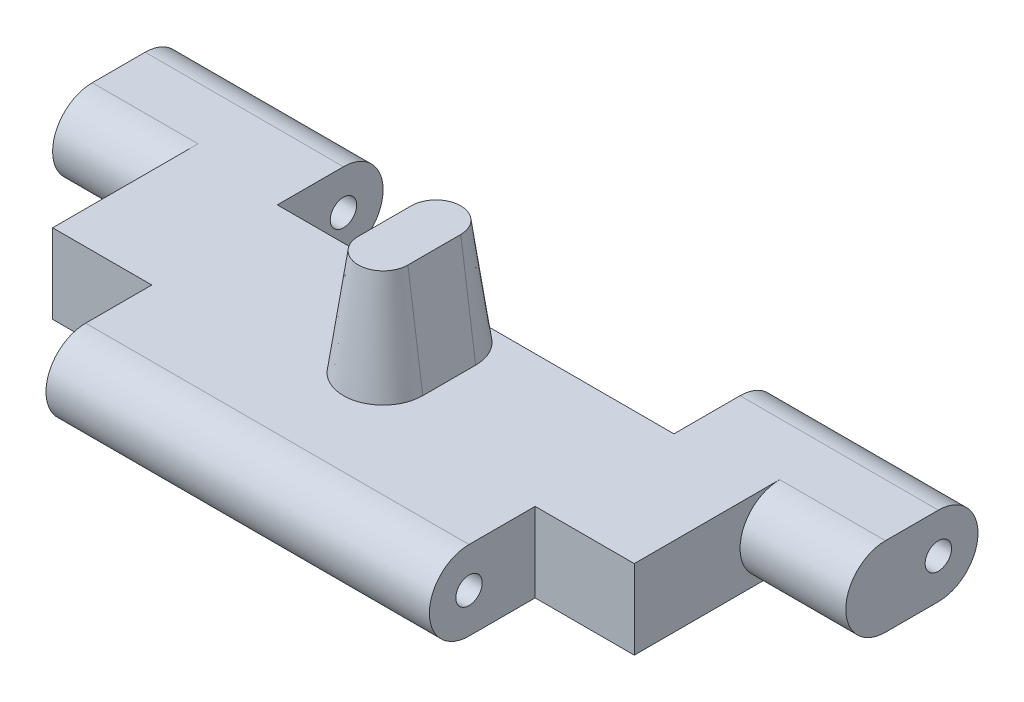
ISO-10303-21;
HEADER;
FILE_DESCRIPTION(('STEP AP214'),'2;1');
FILE_NAME('part.step','',(''),(''),'','','');
FILE_SCHEMA(('AUTOMOTIVE_DESIGN { 1 0 10303 214 1 1 1 1 }'));
ENDSEC;
DATA;
#1=APPLICATION_CONTEXT('core data for automotive mechanical design processes');
#2=APPLICATION_PROTOCOL_DEFINITION('international standard','automotive_design',2000,#1);
#3=PRODUCT_CONTEXT('',#1,'mechanical');
#4=PRODUCT('Part','Part','',(#3));
#5=PRODUCT_RELATED_PRODUCT_CATEGORY('part','',(#4));
#6=PRODUCT_DEFINITION_FORMATION('','',#4);
#7=PRODUCT_DEFINITION_CONTEXT('part definition',#1,'design');
#8=PRODUCT_DEFINITION('design','',#6,#7);
#9=PRODUCT_DEFINITION_SHAPE('','',#8);
#10=(LENGTH_UNIT() NAMED_UNIT(*) SI_UNIT(.MILLI.,.METRE.));
#11=(NAMED_UNIT(*) PLANE_ANGLE_UNIT() SI_UNIT($,.RADIAN.));
#12=(NAMED_UNIT(*) SI_UNIT($,.STERADIAN.) SOLID_ANGLE_UNIT());
#13=UNCERTAINTY_MEASURE_WITH_UNIT(LENGTH_MEASURE(1.E-05),#10,'distance_accuracy_value','');
#14=(GEOMETRIC_REPRESENTATION_CONTEXT(3) GLOBAL_UNCERTAINTY_ASSIGNED_CONTEXT((#13)) GLOBAL_UNIT_ASSIGNED_CONTEXT((#10,
#11,#12)) REPRESENTATION_CONTEXT('',''));
#15=CARTESIAN_POINT('',(0.,0.,0.));
#16=DIRECTION('',(0.,0.,1.));
#17=DIRECTION('',(1.,0.,0.));
#18=AXIS2_PLACEMENT_3D('',#15,#16,#17);
#19=CARTESIAN_POINT('',(15.,1.5,5.));
#20=DIRECTION('',(0.,-1.,0.));
#21=DIRECTION('',(0.,0.,-1.));
#22=AXIS2_PLACEMENT_3D('',#19,#20,#21);
#23=PLANE('',#22);
#24=CARTESIAN_POINT('',(0.,1.5,-1.));
#25=DIRECTION('',(0.,1.,0.));
#26=DIRECTION('',(0.,0.,1.));
#27=AXIS2_PLACEMENT_3D('',#24,#25,#26);
#28=CIRCLE('',#27,1.5);
#29=CARTESIAN_POINT('',(1.5,1.5,-1.));
#30=VERTEX_POINT('',#29);
#31=CARTESIAN_POINT('',(0.,1.5,-2.5));
#32=VERTEX_POINT('',#31);
#33=EDGE_CURVE('E185',#30,#32,#28,.T.);
#34=ORIENTED_EDGE('',*,*,#33,.F.);
#35=DIRECTION('',(0.,0.,-1.));
#36=VECTOR('',#35,1.);
#37=CARTESIAN_POINT('',(1.5,1.5,-1.));
#38=LINE('',#37,#36);
#39=CARTESIAN_POINT('',(1.5,1.5,1.));
#40=VERTEX_POINT('',#39);
#41=EDGE_CURVE('E187',#40,#30,#38,.T.);
#42=ORIENTED_EDGE('',*,*,#41,.F.);
#43=CARTESIAN_POINT('',(0.,1.5,1.));
#44=DIRECTION('',(0.,1.,0.));
#45=DIRECTION('',(0.,0.,1.));
#46=AXIS2_PLACEMENT_3D('',#43,#44,#45);
#47=CIRCLE('',#46,1.5);
#48=CARTESIAN_POINT('',(-1.5,1.5,1.));
#49=VERTEX_POINT('',#48);
#50=EDGE_CURVE('E68',#49,#40,#47,.T.);
#51=ORIENTED_EDGE('',*,*,#50,.F.);
#52=DIRECTION('',(0.,0.,1.));
#53=VECTOR('',#52,1.);
#54=CARTESIAN_POINT('',(-1.5,1.5,-0.999999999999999));
#55=LINE('',#54,#53);
#56=CARTESIAN_POINT('',(-1.5,1.5,-0.999999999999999));
#57=VERTEX_POINT('',#56);
#58=EDGE_CURVE('E63',#57,#49,#55,.T.);
#59=ORIENTED_EDGE('',*,*,#58,.F.);
#60=EDGE_CURVE('E193',#32,#57,#28,.T.);
#61=ORIENTED_EDGE('',*,*,#60,.F.);
#62=DIRECTION('',(1.,0.,0.));
#63=VECTOR('',#62,1.);
#64=CARTESIAN_POINT('',(-7.5,1.5,-2.5));
#65=LINE('',#64,#63);
#66=CARTESIAN_POINT('',(-7.5,1.5,-2.5));
#67=VERTEX_POINT('',#66);
#68=EDGE_CURVE('E296',#67,#32,#65,.T.);
#69=ORIENTED_EDGE('',*,*,#68,.F.);
#70=DIRECTION('',(0.,0.,1.));
#71=VECTOR('',#70,1.);
#72=CARTESIAN_POINT('',(-7.5,1.5,-2.5));
#73=LINE('',#72,#71);
#74=CARTESIAN_POINT('',(-7.5,1.5,-5.));
#75=VERTEX_POINT('',#74);
#76=EDGE_CURVE('E293',#75,#67,#73,.T.);
#77=ORIENTED_EDGE('',*,*,#76,.F.);
#78=DIRECTION('',(-1.,0.,0.));
#79=VECTOR('',#78,1.);
#80=CARTESIAN_POINT('',(15.,1.5,-5.));
#81=LINE('',#80,#79);
#82=CARTESIAN_POINT('',(-15.,1.5,-5.));
#83=VERTEX_POINT('',#82);
#84=EDGE_CURVE('E345',#75,#83,#81,.T.);
#85=ORIENTED_EDGE('',*,*,#84,.T.);
#86=DIRECTION('',(0.,0.,1.));
#87=VECTOR('',#86,1.);
#88=CARTESIAN_POINT('',(-15.,1.5,5.));
#89=LINE('',#88,#87);
#90=CARTESIAN_POINT('',(-15.,1.5,-3.));
#91=VERTEX_POINT('',#90);
#92=EDGE_CURVE('E331',#83,#91,#89,.T.);
#93=ORIENTED_EDGE('',*,*,#92,.T.);
#94=DIRECTION('',(-1.,0.,0.));
#95=VECTOR('',#94,1.);
#96=CARTESIAN_POINT('',(-11.,1.5,-3.));
#97=LINE('',#96,#95);
#98=CARTESIAN_POINT('',(-11.,1.5,-3.));
#99=VERTEX_POINT('',#98);
#100=EDGE_CURVE('E257',#99,#91,#97,.T.);
#101=ORIENTED_EDGE('',*,*,#100,.F.);
#102=DIRECTION('',(0.,0.,-1.));
#103=VECTOR('',#102,1.);
#104=CARTESIAN_POINT('',(-11.,1.5,-3.));
#105=LINE('',#104,#103);
#106=CARTESIAN_POINT('',(-11.,1.5,2.5));
#107=VERTEX_POINT('',#106);
#108=EDGE_CURVE('E252',#107,#99,#105,.T.);
#109=ORIENTED_EDGE('',*,*,#108,.F.);
#110=DIRECTION('',(-1.,0.,0.));
#111=VECTOR('',#110,1.);
#112=CARTESIAN_POINT('',(-15.,1.5,2.5));
#113=LINE('',#112,#111);
#114=CARTESIAN_POINT('',(-7.25,1.5,2.5));
#115=VERTEX_POINT('',#114);
#116=EDGE_CURVE('E278',#115,#107,#113,.T.);
#117=ORIENTED_EDGE('',*,*,#116,.F.);
#118=DIRECTION('',(0.,0.,-1.));
#119=VECTOR('',#118,1.);
#120=CARTESIAN_POINT('',(-7.25,1.5,6.5));
#121=LINE('',#120,#119);
#122=CARTESIAN_POINT('',(-7.25,1.5,5.));
#123=VERTEX_POINT('',#122);
#124=EDGE_CURVE('E259',#123,#115,#121,.T.);
#125=ORIENTED_EDGE('',*,*,#124,.F.);
#126=DIRECTION('',(-1.,0.,0.));
#127=VECTOR('',#126,1.);
#128=CARTESIAN_POINT('',(15.,1.5,5.));
#129=LINE('',#128,#127);
#130=CARTESIAN_POINT('',(7.25,1.5,5.));
#131=VERTEX_POINT('',#130);
#132=EDGE_CURVE('E336',#131,#123,#129,.T.);
#133=ORIENTED_EDGE('',*,*,#132,.F.);
#134=DIRECTION('',(0.,0.,1.));
#135=VECTOR('',#134,1.);
#136=CARTESIAN_POINT('',(7.25,1.5,6.5));
#137=LINE('',#136,#135);
#138=CARTESIAN_POINT('',(7.25,1.5,2.5));
#139=VERTEX_POINT('',#138);
#140=EDGE_CURVE('E264',#139,#131,#137,.T.);
#141=ORIENTED_EDGE('',*,*,#140,.F.);
#142=DIRECTION('',(-1.,0.,0.));
#143=VECTOR('',#142,1.);
#144=CARTESIAN_POINT('',(15.,1.5,2.5));
#145=LINE('',#144,#143);
#146=CARTESIAN_POINT('',(11.,1.5,2.5));
#147=VERTEX_POINT('',#146);
#148=EDGE_CURVE('E262',#147,#139,#145,.T.);
#149=ORIENTED_EDGE('',*,*,#148,.F.);
#150=DIRECTION('',(0.,0.,-1.));
#151=VECTOR('',#150,1.);
#152=CARTESIAN_POINT('',(11.,1.5,-3.));
#153=LINE('',#152,#151);
#154=CARTESIAN_POINT('',(11.,1.5,-3.));
#155=VERTEX_POINT('',#154);
#156=EDGE_CURVE('E227',#147,#155,#153,.T.);
#157=ORIENTED_EDGE('',*,*,#156,.T.);
#158=DIRECTION('',(1.,0.,0.));
#159=VECTOR('',#158,1.);
#160=CARTESIAN_POINT('',(11.,1.5,-3.));
#161=LINE('',#160,#159);
#162=CARTESIAN_POINT('',(15.,1.5,-3.));
#163=VERTEX_POINT('',#162);
#164=EDGE_CURVE('E237',#155,#163,#161,.T.);
#165=ORIENTED_EDGE('',*,*,#164,.T.);
#166=DIRECTION('',(0.,0.,1.));
#167=VECTOR('',#166,1.);
#168=CARTESIAN_POINT('',(15.,1.5,5.));
#169=LINE('',#168,#167);
#170=CARTESIAN_POINT('',(15.,1.5,-5.));
#171=VERTEX_POINT('',#170);
#172=EDGE_CURVE('E333',#171,#163,#169,.T.);
#173=ORIENTED_EDGE('',*,*,#172,.F.);
#174=CARTESIAN_POINT('',(7.5,1.5,-5.));
#175=VERTEX_POINT('',#174);
#176=EDGE_CURVE('E346',#171,#175,#81,.T.);
#177=ORIENTED_EDGE('',*,*,#176,.T.);
#178=DIRECTION('',(0.,0.,-1.));
#179=VECTOR('',#178,1.);
#180=CARTESIAN_POINT('',(7.5,1.5,-2.5));
#181=LINE('',#180,#179);
#182=CARTESIAN_POINT('',(7.5,1.5,-2.5));
#183=VERTEX_POINT('',#182);
#184=EDGE_CURVE('E298',#183,#175,#181,.T.);
#185=ORIENTED_EDGE('',*,*,#184,.F.);
#186=EDGE_CURVE('E189',#32,#183,#65,.T.);
#187=ORIENTED_EDGE('',*,*,#186,.F.);
#188=EDGE_LOOP('',(#34,#42,#51,#59,#61,#69,#77,#85,#93,#101,#109,#117,#125,#133,#141,#149,#157,
#165,#173,#177,#185,#187));
#189=FACE_BOUND('',#188,.T.);
#190=ADVANCED_FACE('F46',(#189),#23,.F.);
#191=CARTESIAN_POINT('',(15.,-1.5,5.));
#192=DIRECTION('',(0.,1.,0.));
#193=DIRECTION('',(0.,0.,1.));
#194=AXIS2_PLACEMENT_3D('',#191,#192,#193);
#195=PLANE('',#194);
#196=DIRECTION('',(1.,0.,0.));
#197=VECTOR('',#196,1.);
#198=CARTESIAN_POINT('',(11.,-1.5,-3.));
#199=LINE('',#198,#197);
#200=CARTESIAN_POINT('',(11.,-1.5,-3.));
#201=VERTEX_POINT('',#200);
#202=CARTESIAN_POINT('',(15.,-1.5,-3.));
#203=VERTEX_POINT('',#202);
#204=EDGE_CURVE('E240',#201,#203,#199,.T.);
#205=ORIENTED_EDGE('',*,*,#204,.F.);
#206=DIRECTION('',(0.,0.,1.));
#207=VECTOR('',#206,1.);
#208=CARTESIAN_POINT('',(11.,-1.5,2.5));
#209=LINE('',#208,#207);
#210=CARTESIAN_POINT('',(11.,-1.5,2.5));
#211=VERTEX_POINT('',#210);
#212=EDGE_CURVE('E234',#201,#211,#209,.T.);
#213=ORIENTED_EDGE('',*,*,#212,.T.);
#214=DIRECTION('',(-1.,0.,0.));
#215=VECTOR('',#214,1.);
#216=CARTESIAN_POINT('',(15.,-1.5,2.5));
#217=LINE('',#216,#215);
#218=CARTESIAN_POINT('',(7.25,-1.5,2.5));
#219=VERTEX_POINT('',#218);
#220=EDGE_CURVE('E268',#211,#219,#217,.T.);
#221=ORIENTED_EDGE('',*,*,#220,.T.);
#222=DIRECTION('',(0.,0.,1.));
#223=VECTOR('',#222,1.);
#224=CARTESIAN_POINT('',(7.25,-1.5,6.5));
#225=LINE('',#224,#223);
#226=CARTESIAN_POINT('',(7.25,-1.5,5.));
#227=VERTEX_POINT('',#226);
#228=EDGE_CURVE('E270',#219,#227,#225,.T.);
#229=ORIENTED_EDGE('',*,*,#228,.T.);
#230=DIRECTION('',(-1.,0.,0.));
#231=VECTOR('',#230,1.);
#232=CARTESIAN_POINT('',(15.,-1.5,5.));
#233=LINE('',#232,#231);
#234=CARTESIAN_POINT('',(-7.25,-1.5,5.));
#235=VERTEX_POINT('',#234);
#236=EDGE_CURVE('E13',#227,#235,#233,.T.);
#237=ORIENTED_EDGE('',*,*,#236,.T.);
#238=DIRECTION('',(0.,0.,-1.));
#239=VECTOR('',#238,1.);
#240=CARTESIAN_POINT('',(-7.25,-1.5,6.5));
#241=LINE('',#240,#239);
#242=CARTESIAN_POINT('',(-7.25,-1.5,2.5));
#243=VERTEX_POINT('',#242);
#244=EDGE_CURVE('E281',#235,#243,#241,.T.);
#245=ORIENTED_EDGE('',*,*,#244,.T.);
#246=DIRECTION('',(-1.,0.,0.));
#247=VECTOR('',#246,1.);
#248=CARTESIAN_POINT('',(-15.,-1.5,2.5));
#249=LINE('',#248,#247);
#250=CARTESIAN_POINT('',(-11.,-1.5,2.5));
#251=VERTEX_POINT('',#250);
#252=EDGE_CURVE('E284',#243,#251,#249,.T.);
#253=ORIENTED_EDGE('',*,*,#252,.T.);
#254=DIRECTION('',(0.,0.,1.));
#255=VECTOR('',#254,1.);
#256=CARTESIAN_POINT('',(-11.,-1.5,2.5));
#257=LINE('',#256,#255);
#258=CARTESIAN_POINT('',(-11.,-1.5,-3.));
#259=VERTEX_POINT('',#258);
#260=EDGE_CURVE('E248',#259,#251,#257,.T.);
#261=ORIENTED_EDGE('',*,*,#260,.F.);
#262=DIRECTION('',(-1.,0.,0.));
#263=VECTOR('',#262,1.);
#264=CARTESIAN_POINT('',(-11.,-1.5,-3.));
#265=LINE('',#264,#263);
#266=CARTESIAN_POINT('',(-15.,-1.5,-3.));
#267=VERTEX_POINT('',#266);
#268=EDGE_CURVE('E255',#259,#267,#265,.T.);
#269=ORIENTED_EDGE('',*,*,#268,.T.);
#270=DIRECTION('',(0.,0.,-1.));
#271=VECTOR('',#270,1.);
#272=CARTESIAN_POINT('',(-15.,-1.5,5.));
#273=LINE('',#272,#271);
#274=CARTESIAN_POINT('',(-15.,-1.5,-5.));
#275=VERTEX_POINT('',#274);
#276=EDGE_CURVE('E325',#267,#275,#273,.T.);
#277=ORIENTED_EDGE('',*,*,#276,.T.);
#278=DIRECTION('',(-1.,0.,0.));
#279=VECTOR('',#278,1.);
#280=CARTESIAN_POINT('',(15.,-1.5,-5.));
#281=LINE('',#280,#279);
#282=CARTESIAN_POINT('',(-7.5,-1.5,-5.));
#283=VERTEX_POINT('',#282);
#284=EDGE_CURVE('E349',#283,#275,#281,.T.);
#285=ORIENTED_EDGE('',*,*,#284,.F.);
#286=DIRECTION('',(0.,0.,1.));
#287=VECTOR('',#286,1.);
#288=CARTESIAN_POINT('',(-7.5,-1.5,-2.5));
#289=LINE('',#288,#287);
#290=CARTESIAN_POINT('',(-7.5,-1.5,-2.5));
#291=VERTEX_POINT('',#290);
#292=EDGE_CURVE('E301',#283,#291,#289,.T.);
#293=ORIENTED_EDGE('',*,*,#292,.T.);
#294=DIRECTION('',(1.,0.,0.));
#295=VECTOR('',#294,1.);
#296=CARTESIAN_POINT('',(-7.5,-1.5,-2.5));
#297=LINE('',#296,#295);
#298=CARTESIAN_POINT('',(7.5,-1.5,-2.5));
#299=VERTEX_POINT('',#298);
#300=EDGE_CURVE('E304',#291,#299,#297,.T.);
#301=ORIENTED_EDGE('',*,*,#300,.T.);
#302=DIRECTION('',(0.,0.,-1.));
#303=VECTOR('',#302,1.);
#304=CARTESIAN_POINT('',(7.5,-1.5,-2.5));
#305=LINE('',#304,#303);
#306=CARTESIAN_POINT('',(7.5,-1.5,-5.));
#307=VERTEX_POINT('',#306);
#308=EDGE_CURVE('E307',#299,#307,#305,.T.);
#309=ORIENTED_EDGE('',*,*,#308,.T.);
#310=CARTESIAN_POINT('',(15.,-1.5,-5.));
#311=VERTEX_POINT('',#310);
#312=EDGE_CURVE('E55',#311,#307,#281,.T.);
#313=ORIENTED_EDGE('',*,*,#312,.F.);
#314=DIRECTION('',(0.,0.,-1.));
#315=VECTOR('',#314,1.);
#316=CARTESIAN_POINT('',(15.,-1.5,5.));
#317=LINE('',#316,#315);
#318=EDGE_CURVE('E328',#203,#311,#317,.T.);
#319=ORIENTED_EDGE('',*,*,#318,.F.);
#320=EDGE_LOOP('',(#205,#213,#221,#229,#237,#245,#253,#261,#269,#277,#285,#293,#301,#309,#313,#319));
#321=FACE_BOUND('',#320,.T.);
#322=ADVANCED_FACE('F380',(#321),#195,.F.);
#323=CARTESIAN_POINT('',(15.,0.,5.));
#324=DIRECTION('',(1.,0.,0.));
#325=DIRECTION('',(0.,0.,-1.));
#326=AXIS2_PLACEMENT_3D('',#323,#324,#325);
#327=PLANE('',#326);
#328=CARTESIAN_POINT('',(15.,0.,-5.));
#329=DIRECTION('',(1.,0.,0.));
#330=DIRECTION('',(0.,0.,-1.));
#331=AXIS2_PLACEMENT_3D('',#328,#329,#330);
#332=CIRCLE('',#331,0.5);
#333=CARTESIAN_POINT('',(15.,0.,-5.5));
#334=VERTEX_POINT('',#333);
#335=EDGE_CURVE('E322',#334,#334,#332,.T.);
#336=ORIENTED_EDGE('',*,*,#335,.F.);
#337=EDGE_LOOP('',(#336));
#338=FACE_BOUND('',#337,.T.);
#339=ORIENTED_EDGE('',*,*,#172,.T.);
#340=CARTESIAN_POINT('',(15.,0.,-3.));
#341=DIRECTION('',(1.,0.,0.));
#342=DIRECTION('',(0.,0.,1.));
#343=AXIS2_PLACEMENT_3D('',#340,#341,#342);
#344=CIRCLE('',#343,1.5);
#345=EDGE_CURVE('E228',#163,#203,#344,.T.);
#346=ORIENTED_EDGE('',*,*,#345,.T.);
#347=ORIENTED_EDGE('',*,*,#318,.T.);
#348=CARTESIAN_POINT('',(15.,0.,-5.));
#349=DIRECTION('',(1.,0.,0.));
#350=DIRECTION('',(0.,0.,-1.));
#351=AXIS2_PLACEMENT_3D('',#348,#349,#350);
#352=CIRCLE('',#351,1.5);
#353=EDGE_CURVE('E330',#311,#171,#352,.T.);
#354=ORIENTED_EDGE('',*,*,#353,.T.);
#355=EDGE_LOOP('',(#339,#346,#347,#354));
#356=FACE_BOUND('',#355,.T.);
#357=ADVANCED_FACE('F385',(#338,#356),#327,.T.);
#358=CARTESIAN_POINT('',(15.,-1.5,2.5));
#359=DIRECTION('',(0.,0.,-1.));
#360=DIRECTION('',(-1.,0.,0.));
#361=AXIS2_PLACEMENT_3D('',#358,#359,#360);
#362=PLANE('',#361);
#363=DIRECTION('',(0.,1.,0.));
#364=VECTOR('',#363,1.);
#365=CARTESIAN_POINT('',(11.,1.5,2.5));
#366=LINE('',#365,#364);
#367=EDGE_CURVE('E231',#211,#147,#366,.T.);
#368=ORIENTED_EDGE('',*,*,#367,.T.);
#369=ORIENTED_EDGE('',*,*,#148,.T.);
#370=DIRECTION('',(0.,1.,0.));
#371=VECTOR('',#370,1.);
#372=CARTESIAN_POINT('',(7.25,-1.5,2.5));
#373=LINE('',#372,#371);
#374=EDGE_CURVE('E273',#219,#139,#373,.T.);
#375=ORIENTED_EDGE('',*,*,#374,.F.);
#376=ORIENTED_EDGE('',*,*,#220,.F.);
#377=EDGE_LOOP('',(#368,#369,#375,#376));
#378=FACE_BOUND('',#377,.T.);
#379=ADVANCED_FACE('F412',(#378),#362,.F.);
#380=CARTESIAN_POINT('',(-15.,-1.5,2.5));
#381=DIRECTION('',(0.,0.,-1.));
#382=DIRECTION('',(-1.,0.,0.));
#383=AXIS2_PLACEMENT_3D('',#380,#381,#382);
#384=PLANE('',#383);
#385=DIRECTION('',(0.,1.,0.));
#386=VECTOR('',#385,1.);
#387=CARTESIAN_POINT('',(-11.,1.5,2.5));
#388=LINE('',#387,#386);
#389=EDGE_CURVE('E250',#251,#107,#388,.T.);
#390=ORIENTED_EDGE('',*,*,#389,.F.);
#391=ORIENTED_EDGE('',*,*,#252,.F.);
#392=DIRECTION('',(0.,1.,0.));
#393=VECTOR('',#392,1.);
#394=CARTESIAN_POINT('',(-7.25,-1.5,2.5));
#395=LINE('',#394,#393);
#396=EDGE_CURVE('E265',#243,#115,#395,.T.);
#397=ORIENTED_EDGE('',*,*,#396,.T.);
#398=ORIENTED_EDGE('',*,*,#116,.T.);
#399=EDGE_LOOP('',(#390,#391,#397,#398));
#400=FACE_BOUND('',#399,.T.);
#401=ADVANCED_FACE('F405',(#400),#384,.F.);
#402=CARTESIAN_POINT('',(15.,0.,-5.));
#403=DIRECTION('',(-1.,0.,0.));
#404=DIRECTION('',(0.,0.,1.));
#405=AXIS2_PLACEMENT_3D('',#402,#403,#404);
#406=CYLINDRICAL_SURFACE('',#405,1.5);
#407=ORIENTED_EDGE('',*,*,#84,.F.);
#408=CARTESIAN_POINT('',(-7.5,0.,-5.));
#409=DIRECTION('',(-1.,0.,0.));
#410=DIRECTION('',(0.,0.,1.));
#411=AXIS2_PLACEMENT_3D('',#408,#409,#410);
#412=CIRCLE('',#411,1.5);
#413=EDGE_CURVE('E319',#75,#283,#412,.T.);
#414=ORIENTED_EDGE('',*,*,#413,.T.);
#415=ORIENTED_EDGE('',*,*,#284,.T.);
#416=CARTESIAN_POINT('',(-15.,0.,-5.));
#417=DIRECTION('',(1.,0.,0.));
#418=DIRECTION('',(0.,0.,-1.));
#419=AXIS2_PLACEMENT_3D('',#416,#417,#418);
#420=CIRCLE('',#419,1.5);
#421=EDGE_CURVE('E338',#275,#83,#420,.T.);
#422=ORIENTED_EDGE('',*,*,#421,.T.);
#423=EDGE_LOOP('',(#407,#414,#415,#422));
#424=FACE_BOUND('',#423,.T.);
#425=ADVANCED_FACE('F395',(#424),#406,.T.);
#426=CARTESIAN_POINT('',(15.,0.,-5.));
#427=DIRECTION('',(-1.,0.,0.));
#428=DIRECTION('',(0.,0.,1.));
#429=AXIS2_PLACEMENT_3D('',#426,#427,#428);
#430=CYLINDRICAL_SURFACE('',#429,0.5);
#431=CARTESIAN_POINT('',(-7.5,0.,-5.));
#432=DIRECTION('',(-1.,0.,0.));
#433=DIRECTION('',(0.,0.,1.));
#434=AXIS2_PLACEMENT_3D('',#431,#432,#433);
#435=CIRCLE('',#434,0.5);
#436=CARTESIAN_POINT('',(-7.5,0.,-4.5));
#437=VERTEX_POINT('',#436);
#438=EDGE_CURVE('E318',#437,#437,#435,.T.);
#439=ORIENTED_EDGE('',*,*,#438,.F.);
#440=EDGE_LOOP('',(#439));
#441=FACE_BOUND('',#440,.T.);
#442=CARTESIAN_POINT('',(-15.,0.,-5.));
#443=DIRECTION('',(1.,0.,0.));
#444=DIRECTION('',(0.,0.,-1.));
#445=AXIS2_PLACEMENT_3D('',#442,#443,#444);
#446=CIRCLE('',#445,0.5);
#447=CARTESIAN_POINT('',(-15.,0.,-5.5));
#448=VERTEX_POINT('',#447);
#449=EDGE_CURVE('E321',#448,#448,#446,.T.);
#450=ORIENTED_EDGE('',*,*,#449,.F.);
#451=EDGE_LOOP('',(#450));
#452=FACE_BOUND('',#451,.T.);
#453=ADVANCED_FACE('F402',(#441,#452),#430,.F.);
#454=CARTESIAN_POINT('',(-15.,0.,5.));
#455=DIRECTION('',(1.,0.,0.));
#456=DIRECTION('',(0.,0.,-1.));
#457=AXIS2_PLACEMENT_3D('',#454,#455,#456);
#458=PLANE('',#457);
#459=ORIENTED_EDGE('',*,*,#276,.F.);
#460=CARTESIAN_POINT('',(-15.,0.,-3.));
#461=DIRECTION('',(1.,0.,0.));
#462=DIRECTION('',(0.,0.,1.));
#463=AXIS2_PLACEMENT_3D('',#460,#461,#462);
#464=CIRCLE('',#463,1.5);
#465=EDGE_CURVE('E242',#91,#267,#464,.T.);
#466=ORIENTED_EDGE('',*,*,#465,.F.);
#467=ORIENTED_EDGE('',*,*,#92,.F.);
#468=ORIENTED_EDGE('',*,*,#421,.F.);
#469=EDGE_LOOP('',(#459,#466,#467,#468));
#470=FACE_BOUND('',#469,.T.);
#471=ORIENTED_EDGE('',*,*,#449,.T.);
#472=EDGE_LOOP('',(#471));
#473=FACE_BOUND('',#472,.T.);
#474=ADVANCED_FACE('F389',(#470,#473),#458,.F.);
#475=CARTESIAN_POINT('',(15.,0.,5.));
#476=DIRECTION('',(-1.,0.,0.));
#477=DIRECTION('',(0.,0.,1.));
#478=AXIS2_PLACEMENT_3D('',#475,#476,#477);
#479=CYLINDRICAL_SURFACE('',#478,1.5);
#480=CARTESIAN_POINT('',(7.25,0.,5.));
#481=DIRECTION('',(-1.,0.,0.));
#482=DIRECTION('',(0.,0.,1.));
#483=AXIS2_PLACEMENT_3D('',#480,#481,#482);
#484=CIRCLE('',#483,1.5);
#485=EDGE_CURVE('E291',#227,#131,#484,.T.);
#486=ORIENTED_EDGE('',*,*,#485,.T.);
#487=ORIENTED_EDGE('',*,*,#132,.T.);
#488=CARTESIAN_POINT('',(-7.25,0.,5.));
#489=DIRECTION('',(1.,0.,0.));
#490=DIRECTION('',(0.,0.,-1.));
#491=AXIS2_PLACEMENT_3D('',#488,#489,#490);
#492=CIRCLE('',#491,1.5);
#493=EDGE_CURVE('E289',#123,#235,#492,.T.);
#494=ORIENTED_EDGE('',*,*,#493,.T.);
#495=ORIENTED_EDGE('',*,*,#236,.F.);
#496=EDGE_LOOP('',(#486,#487,#494,#495));
#497=FACE_BOUND('',#496,.T.);
#498=ADVANCED_FACE('F48',(#497),#479,.T.);
#499=CARTESIAN_POINT('',(7.5,0.,-5.));
#500=DIRECTION('',(1.,0.,0.));
#501=DIRECTION('',(0.,0.,-1.));
#502=AXIS2_PLACEMENT_3D('',#499,#500,#501);
#503=CIRCLE('',#502,1.5);
#504=EDGE_CURVE('E316',#307,#175,#503,.T.);
#505=ORIENTED_EDGE('',*,*,#504,.T.);
#506=ORIENTED_EDGE('',*,*,#176,.F.);
#507=ORIENTED_EDGE('',*,*,#353,.F.);
#508=ORIENTED_EDGE('',*,*,#312,.T.);
#509=EDGE_LOOP('',(#505,#506,#507,#508));
#510=FACE_BOUND('',#509,.T.);
#511=ADVANCED_FACE('F391',(#510),#406,.T.);
#512=CARTESIAN_POINT('',(7.5,0.,-5.));
#513=DIRECTION('',(1.,0.,0.));
#514=DIRECTION('',(0.,0.,-1.));
#515=AXIS2_PLACEMENT_3D('',#512,#513,#514);
#516=CIRCLE('',#515,0.5);
#517=CARTESIAN_POINT('',(7.5,0.,-5.5));
#518=VERTEX_POINT('',#517);
#519=EDGE_CURVE('E314',#518,#518,#516,.T.);
#520=ORIENTED_EDGE('',*,*,#519,.F.);
#521=EDGE_LOOP('',(#520));
#522=FACE_BOUND('',#521,.T.);
#523=ORIENTED_EDGE('',*,*,#335,.T.);
#524=EDGE_LOOP('',(#523));
#525=FACE_BOUND('',#524,.T.);
#526=ADVANCED_FACE('F393',(#522,#525),#430,.F.);
#527=CARTESIAN_POINT('',(-7.5,-1.5,-2.5));
#528=DIRECTION('',(-1.,0.,0.));
#529=DIRECTION('',(0.,0.,1.));
#530=AXIS2_PLACEMENT_3D('',#527,#528,#529);
#531=PLANE('',#530);
#532=ORIENTED_EDGE('',*,*,#438,.T.);
#533=EDGE_LOOP('',(#532));
#534=FACE_BOUND('',#533,.T.);
#535=ORIENTED_EDGE('',*,*,#76,.T.);
#536=DIRECTION('',(0.,1.,0.));
#537=VECTOR('',#536,1.);
#538=CARTESIAN_POINT('',(-7.5,-1.5,-2.5));
#539=LINE('',#538,#537);
#540=EDGE_CURVE('E310',#291,#67,#539,.T.);
#541=ORIENTED_EDGE('',*,*,#540,.F.);
#542=ORIENTED_EDGE('',*,*,#292,.F.);
#543=ORIENTED_EDGE('',*,*,#413,.F.);
#544=EDGE_LOOP('',(#535,#541,#542,#543));
#545=FACE_BOUND('',#544,.T.);
#546=ADVANCED_FACE('F400',(#534,#545),#531,.F.);
#547=CARTESIAN_POINT('',(7.5,-1.5,-2.5));
#548=DIRECTION('',(1.,0.,0.));
#549=DIRECTION('',(0.,0.,-1.));
#550=AXIS2_PLACEMENT_3D('',#547,#548,#549);
#551=PLANE('',#550);
#552=ORIENTED_EDGE('',*,*,#519,.T.);
#553=EDGE_LOOP('',(#552));
#554=FACE_BOUND('',#553,.T.);
#555=ORIENTED_EDGE('',*,*,#504,.F.);
#556=ORIENTED_EDGE('',*,*,#308,.F.);
#557=DIRECTION('',(0.,1.,0.));
#558=VECTOR('',#557,1.);
#559=CARTESIAN_POINT('',(7.5,-1.5,-2.5));
#560=LINE('',#559,#558);
#561=EDGE_CURVE('E311',#299,#183,#560,.T.);
#562=ORIENTED_EDGE('',*,*,#561,.T.);
#563=ORIENTED_EDGE('',*,*,#184,.T.);
#564=EDGE_LOOP('',(#555,#556,#562,#563));
#565=FACE_BOUND('',#564,.T.);
#566=ADVANCED_FACE('F461',(#554,#565),#551,.F.);
#567=CARTESIAN_POINT('',(-7.5,-1.5,-2.5));
#568=DIRECTION('',(0.,0.,1.));
#569=DIRECTION('',(1.,0.,0.));
#570=AXIS2_PLACEMENT_3D('',#567,#568,#569);
#571=PLANE('',#570);
#572=ORIENTED_EDGE('',*,*,#561,.F.);
#573=ORIENTED_EDGE('',*,*,#300,.F.);
#574=ORIENTED_EDGE('',*,*,#540,.T.);
#575=ORIENTED_EDGE('',*,*,#68,.T.);
#576=ORIENTED_EDGE('',*,*,#186,.T.);
#577=EDGE_LOOP('',(#572,#573,#574,#575,#576));
#578=FACE_BOUND('',#577,.T.);
#579=ADVANCED_FACE('F463',(#578),#571,.F.);
#580=CARTESIAN_POINT('',(-7.25,-1.5,6.5));
#581=DIRECTION('',(1.,0.,0.));
#582=DIRECTION('',(0.,0.,-1.));
#583=AXIS2_PLACEMENT_3D('',#580,#581,#582);
#584=PLANE('',#583);
#585=CARTESIAN_POINT('',(-7.25,0.,5.));
#586=DIRECTION('',(1.,0.,0.));
#587=DIRECTION('',(0.,0.,-1.));
#588=AXIS2_PLACEMENT_3D('',#585,#586,#587);
#589=CIRCLE('',#588,0.5);
#590=CARTESIAN_POINT('',(-7.25,0.,4.5));
#591=VERTEX_POINT('',#590);
#592=EDGE_CURVE('E276',#591,#591,#589,.T.);
#593=ORIENTED_EDGE('',*,*,#592,.T.);
#594=EDGE_LOOP('',(#593));
#595=FACE_BOUND('',#594,.T.);
#596=ORIENTED_EDGE('',*,*,#124,.T.);
#597=ORIENTED_EDGE('',*,*,#396,.F.);
#598=ORIENTED_EDGE('',*,*,#244,.F.);
#599=ORIENTED_EDGE('',*,*,#493,.F.);
#600=EDGE_LOOP('',(#596,#597,#598,#599));
#601=FACE_BOUND('',#600,.T.);
#602=ADVANCED_FACE('F358',(#595,#601),#584,.F.);
#603=CARTESIAN_POINT('',(7.25,-1.5,6.5));
#604=DIRECTION('',(-1.,0.,0.));
#605=DIRECTION('',(0.,0.,1.));
#606=AXIS2_PLACEMENT_3D('',#603,#604,#605);
#607=PLANE('',#606);
#608=CARTESIAN_POINT('',(7.25,0.,5.));
#609=DIRECTION('',(-1.,0.,0.));
#610=DIRECTION('',(0.,0.,1.));
#611=AXIS2_PLACEMENT_3D('',#608,#609,#610);
#612=CIRCLE('',#611,0.5);
#613=CARTESIAN_POINT('',(7.25,0.,5.5));
#614=VERTEX_POINT('',#613);
#615=EDGE_CURVE('E50',#614,#614,#612,.T.);
#616=ORIENTED_EDGE('',*,*,#615,.T.);
#617=EDGE_LOOP('',(#616));
#618=FACE_BOUND('',#617,.T.);
#619=ORIENTED_EDGE('',*,*,#485,.F.);
#620=ORIENTED_EDGE('',*,*,#228,.F.);
#621=ORIENTED_EDGE('',*,*,#374,.T.);
#622=ORIENTED_EDGE('',*,*,#140,.T.);
#623=EDGE_LOOP('',(#619,#620,#621,#622));
#624=FACE_BOUND('',#623,.T.);
#625=ADVANCED_FACE('F364',(#618,#624),#607,.F.);
#626=CARTESIAN_POINT('',(15.,0.,5.));
#627=DIRECTION('',(-1.,0.,0.));
#628=DIRECTION('',(0.,0.,1.));
#629=AXIS2_PLACEMENT_3D('',#626,#627,#628);
#630=CYLINDRICAL_SURFACE('',#629,0.5);
#631=ORIENTED_EDGE('',*,*,#615,.F.);
#632=EDGE_LOOP('',(#631));
#633=FACE_BOUND('',#632,.T.);
#634=ORIENTED_EDGE('',*,*,#592,.F.);
#635=EDGE_LOOP('',(#634));
#636=FACE_BOUND('',#635,.T.);
#637=ADVANCED_FACE('F361',(#633,#636),#630,.F.);
#638=CARTESIAN_POINT('',(-11.,0.,-3.));
#639=DIRECTION('',(-1.,0.,0.));
#640=DIRECTION('',(0.,0.,1.));
#641=AXIS2_PLACEMENT_3D('',#638,#639,#640);
#642=CYLINDRICAL_SURFACE('',#641,1.5);
#643=ORIENTED_EDGE('',*,*,#465,.T.);
#644=ORIENTED_EDGE('',*,*,#268,.F.);
#645=CARTESIAN_POINT('',(-11.,0.,-3.));
#646=DIRECTION('',(1.,0.,0.));
#647=DIRECTION('',(0.,0.,1.));
#648=AXIS2_PLACEMENT_3D('',#645,#646,#647);
#649=CIRCLE('',#648,1.5);
#650=EDGE_CURVE('E245',#99,#259,#649,.T.);
#651=ORIENTED_EDGE('',*,*,#650,.F.);
#652=ORIENTED_EDGE('',*,*,#100,.T.);
#653=EDGE_LOOP('',(#643,#644,#651,#652));
#654=FACE_BOUND('',#653,.T.);
#655=ADVANCED_FACE('F363',(#654),#642,.T.);
#656=CARTESIAN_POINT('',(-11.,0.,-3.));
#657=DIRECTION('',(-1.,0.,0.));
#658=DIRECTION('',(0.,0.,1.));
#659=AXIS2_PLACEMENT_3D('',#656,#657,#658);
#660=PLANE('',#659);
#661=ORIENTED_EDGE('',*,*,#650,.T.);
#662=ORIENTED_EDGE('',*,*,#260,.T.);
#663=ORIENTED_EDGE('',*,*,#389,.T.);
#664=ORIENTED_EDGE('',*,*,#108,.T.);
#665=EDGE_LOOP('',(#661,#662,#663,#664));
#666=FACE_BOUND('',#665,.T.);
#667=ADVANCED_FACE('F371',(#666),#660,.T.);
#668=CARTESIAN_POINT('',(11.,0.,-3.));
#669=DIRECTION('',(1.,0.,0.));
#670=DIRECTION('',(0.,0.,-1.));
#671=AXIS2_PLACEMENT_3D('',#668,#669,#670);
#672=CYLINDRICAL_SURFACE('',#671,1.5);
#673=ORIENTED_EDGE('',*,*,#345,.F.);
#674=ORIENTED_EDGE('',*,*,#164,.F.);
#675=CARTESIAN_POINT('',(11.,0.,-3.));
#676=DIRECTION('',(1.,0.,0.));
#677=DIRECTION('',(0.,0.,1.));
#678=AXIS2_PLACEMENT_3D('',#675,#676,#677);
#679=CIRCLE('',#678,1.5);
#680=EDGE_CURVE('E224',#155,#201,#679,.T.);
#681=ORIENTED_EDGE('',*,*,#680,.T.);
#682=ORIENTED_EDGE('',*,*,#204,.T.);
#683=EDGE_LOOP('',(#673,#674,#681,#682));
#684=FACE_BOUND('',#683,.T.);
#685=ADVANCED_FACE('F454',(#684),#672,.T.);
#686=CARTESIAN_POINT('',(11.,0.,-3.));
#687=DIRECTION('',(1.,0.,0.));
#688=DIRECTION('',(0.,0.,1.));
#689=AXIS2_PLACEMENT_3D('',#686,#687,#688);
#690=PLANE('',#689);
#691=ORIENTED_EDGE('',*,*,#680,.F.);
#692=ORIENTED_EDGE('',*,*,#156,.F.);
#693=ORIENTED_EDGE('',*,*,#367,.F.);
#694=ORIENTED_EDGE('',*,*,#212,.F.);
#695=EDGE_LOOP('',(#691,#692,#693,#694));
#696=FACE_BOUND('',#695,.T.);
#697=ADVANCED_FACE('F450',(#696),#690,.T.);
#698=CARTESIAN_POINT('',(0.,1.5,-1.));
#699=DIRECTION('',(0.,-1.,0.));
#700=DIRECTION('',(0.,0.,1.));
#701=AXIS2_PLACEMENT_3D('',#698,#699,#700);
#702=CONICAL_SURFACE('',#701,1.5,0.139626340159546);
#703=ORIENTED_EDGE('',*,*,#33,.T.);
#704=ORIENTED_EDGE('',*,*,#60,.T.);
#705=DIRECTION('',(-0.139173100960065,-0.99026806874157,0.));
#706=VECTOR('',#705,1.);
#707=CARTESIAN_POINT('',(-1.5,1.5,-0.999999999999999));
#708=LINE('',#707,#706);
#709=CARTESIAN_POINT('',(-0.937836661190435,5.5,-0.999999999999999));
#710=VERTEX_POINT('',#709);
#711=EDGE_CURVE('E216',#710,#57,#708,.T.);
#712=ORIENTED_EDGE('',*,*,#711,.F.);
#713=CARTESIAN_POINT('',(0.,5.5,-0.999999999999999));
#714=DIRECTION('',(0.,1.,0.));
#715=DIRECTION('',(0.,0.,1.));
#716=AXIS2_PLACEMENT_3D('',#713,#714,#715);
#717=CIRCLE('',#716,0.937836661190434);
#718=CARTESIAN_POINT('',(0.937836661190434,5.5,-0.999999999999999));
#719=VERTEX_POINT('',#718);
#720=EDGE_CURVE('E204',#719,#710,#717,.T.);
#721=ORIENTED_EDGE('',*,*,#720,.F.);
#722=DIRECTION('',(0.139173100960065,-0.99026806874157,0.));
#723=VECTOR('',#722,1.);
#724=CARTESIAN_POINT('',(1.5,1.5,-1.));
#725=LINE('',#724,#723);
#726=EDGE_CURVE('E200',#719,#30,#725,.T.);
#727=ORIENTED_EDGE('',*,*,#726,.T.);
#728=EDGE_LOOP('',(#703,#704,#712,#721,#727));
#729=FACE_BOUND('',#728,.T.);
#730=ADVANCED_FACE('F206',(#729),#702,.T.);
#731=CARTESIAN_POINT('',(-1.5,1.5,-0.999999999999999));
#732=DIRECTION('',(-0.99026806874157,0.139173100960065,0.));
#733=DIRECTION('',(-0.139173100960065,-0.99026806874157,0.));
#734=AXIS2_PLACEMENT_3D('',#731,#732,#733);
#735=PLANE('',#734);
#736=ORIENTED_EDGE('',*,*,#58,.T.);
#737=DIRECTION('',(-0.139173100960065,-0.99026806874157,0.));
#738=VECTOR('',#737,1.);
#739=CARTESIAN_POINT('',(-1.5,1.5,1.));
#740=LINE('',#739,#738);
#741=CARTESIAN_POINT('',(-0.937836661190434,5.5,1.));
#742=VERTEX_POINT('',#741);
#743=EDGE_CURVE('E211',#742,#49,#740,.T.);
#744=ORIENTED_EDGE('',*,*,#743,.F.);
#745=DIRECTION('',(0.,0.,-1.));
#746=VECTOR('',#745,1.);
#747=CARTESIAN_POINT('',(-0.937836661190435,5.5,-0.999999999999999));
#748=LINE('',#747,#746);
#749=EDGE_CURVE('E221',#710,#742,#748,.F.);
#750=ORIENTED_EDGE('',*,*,#749,.F.);
#751=ORIENTED_EDGE('',*,*,#711,.T.);
#752=EDGE_LOOP('',(#736,#744,#750,#751));
#753=FACE_BOUND('',#752,.T.);
#754=ADVANCED_FACE('F587',(#753),#735,.T.);
#755=CARTESIAN_POINT('',(0.,1.5,1.));
#756=DIRECTION('',(0.,-1.,0.));
#757=DIRECTION('',(0.,0.,1.));
#758=AXIS2_PLACEMENT_3D('',#755,#756,#757);
#759=CONICAL_SURFACE('',#758,1.5,0.139626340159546);
#760=ORIENTED_EDGE('',*,*,#50,.T.);
#761=DIRECTION('',(0.139173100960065,-0.99026806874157,0.));
#762=VECTOR('',#761,1.);
#763=CARTESIAN_POINT('',(1.5,1.5,1.));
#764=LINE('',#763,#762);
#765=CARTESIAN_POINT('',(0.937836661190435,5.5,1.));
#766=VERTEX_POINT('',#765);
#767=EDGE_CURVE('E203',#766,#40,#764,.T.);
#768=ORIENTED_EDGE('',*,*,#767,.F.);
#769=CARTESIAN_POINT('',(0.,5.5,1.));
#770=DIRECTION('',(0.,1.,0.));
#771=DIRECTION('',(0.,0.,1.));
#772=AXIS2_PLACEMENT_3D('',#769,#770,#771);
#773=CIRCLE('',#772,0.937836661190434);
#774=EDGE_CURVE('E213',#742,#766,#773,.T.);
#775=ORIENTED_EDGE('',*,*,#774,.F.);
#776=ORIENTED_EDGE('',*,*,#743,.T.);
#777=EDGE_LOOP('',(#760,#768,#775,#776));
#778=FACE_BOUND('',#777,.T.);
#779=ADVANCED_FACE('F594',(#778),#759,.T.);
#780=CARTESIAN_POINT('',(1.5,1.5,-1.));
#781=DIRECTION('',(0.99026806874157,0.139173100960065,0.));
#782=DIRECTION('',(-0.139173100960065,0.99026806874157,0.));
#783=AXIS2_PLACEMENT_3D('',#780,#781,#782);
#784=PLANE('',#783);
#785=ORIENTED_EDGE('',*,*,#41,.T.);
#786=ORIENTED_EDGE('',*,*,#726,.F.);
#787=DIRECTION('',(0.,0.,1.));
#788=VECTOR('',#787,1.);
#789=CARTESIAN_POINT('',(0.937836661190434,5.5,-1.));
#790=LINE('',#789,#788);
#791=EDGE_CURVE('E209',#766,#719,#790,.F.);
#792=ORIENTED_EDGE('',*,*,#791,.F.);
#793=ORIENTED_EDGE('',*,*,#767,.T.);
#794=EDGE_LOOP('',(#785,#786,#792,#793));
#795=FACE_BOUND('',#794,.T.);
#796=ADVANCED_FACE('F198',(#795),#784,.T.);
#797=CARTESIAN_POINT('',(0.,5.5,-0.999999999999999));
#798=DIRECTION('',(0.,1.,0.));
#799=DIRECTION('',(0.,0.,1.));
#800=AXIS2_PLACEMENT_3D('',#797,#798,#799);
#801=PLANE('',#800);
#802=ORIENTED_EDGE('',*,*,#720,.T.);
#803=ORIENTED_EDGE('',*,*,#749,.T.);
#804=ORIENTED_EDGE('',*,*,#774,.T.);
#805=ORIENTED_EDGE('',*,*,#791,.T.);
#806=EDGE_LOOP('',(#802,#803,#804,#805));
#807=FACE_BOUND('',#806,.T.);
#808=ADVANCED_FACE('F609',(#807),#801,.T.);
#809=CLOSED_SHELL('',(#190,#322,#357,#379,#401,#425,#453,#474,#498,#511,#526,#546,#566,#579,
#602,#625,#637,#655,#667,#685,#697,#730,#754,#779,#796,#808));
#810=MANIFOLD_SOLID_BREP('B2',#809);
#811=ADVANCED_BREP_SHAPE_REPRESENTATION('',(#18,#810),#14);
#812=SHAPE_DEFINITION_REPRESENTATION(#9,#811);
ENDSEC;
END-ISO-10303-21;
